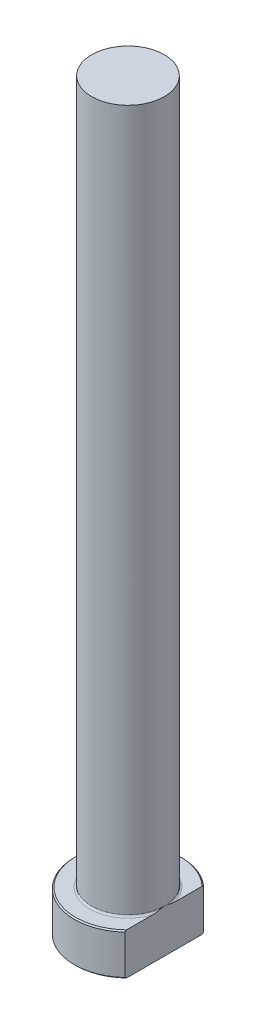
ISO-10303-21;
HEADER;
FILE_DESCRIPTION(('STEP AP214'),'2;1');
FILE_NAME('part.step','',(''),(''),'','','');
FILE_SCHEMA(('AUTOMOTIVE_DESIGN { 1 0 10303 214 1 1 1 1 }'));
ENDSEC;
DATA;
#1=APPLICATION_CONTEXT('core data for automotive mechanical design processes');
#2=APPLICATION_PROTOCOL_DEFINITION('international standard','automotive_design',2000,#1);
#3=PRODUCT_CONTEXT('',#1,'mechanical');
#4=PRODUCT('Part','Part','',(#3));
#5=PRODUCT_RELATED_PRODUCT_CATEGORY('part','',(#4));
#6=PRODUCT_DEFINITION_FORMATION('','',#4);
#7=PRODUCT_DEFINITION_CONTEXT('part definition',#1,'design');
#8=PRODUCT_DEFINITION('design','',#6,#7);
#9=PRODUCT_DEFINITION_SHAPE('','',#8);
#10=(LENGTH_UNIT() NAMED_UNIT(*) SI_UNIT(.MILLI.,.METRE.));
#11=(NAMED_UNIT(*) PLANE_ANGLE_UNIT() SI_UNIT($,.RADIAN.));
#12=(NAMED_UNIT(*) SI_UNIT($,.STERADIAN.) SOLID_ANGLE_UNIT());
#13=UNCERTAINTY_MEASURE_WITH_UNIT(LENGTH_MEASURE(1.E-05),#10,'distance_accuracy_value','');
#14=(GEOMETRIC_REPRESENTATION_CONTEXT(3) GLOBAL_UNCERTAINTY_ASSIGNED_CONTEXT((#13)) GLOBAL_UNIT_ASSIGNED_CONTEXT((#10,
#11,#12)) REPRESENTATION_CONTEXT('',''));
#15=CARTESIAN_POINT('',(0.,0.,0.));
#16=DIRECTION('',(0.,0.,1.));
#17=DIRECTION('',(1.,0.,0.));
#18=AXIS2_PLACEMENT_3D('',#15,#16,#17);
#19=CARTESIAN_POINT('',(0.,0.,0.));
#20=DIRECTION('',(0.,-1.,0.));
#21=DIRECTION('',(0.,0.,-1.));
#22=AXIS2_PLACEMENT_3D('',#19,#20,#21);
#23=PLANE('',#22);
#24=CARTESIAN_POINT('',(0.,0.,0.));
#25=DIRECTION('',(0.,-1.,0.));
#26=DIRECTION('',(0.,0.,-1.));
#27=AXIS2_PLACEMENT_3D('',#24,#25,#26);
#28=CIRCLE('',#27,8.79999999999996);
#29=CARTESIAN_POINT('',(6.09999999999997,0.,6.34271235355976));
#30=VERTEX_POINT('',#29);
#31=CARTESIAN_POINT('',(6.09999999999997,0.,-6.34271235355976));
#32=VERTEX_POINT('',#31);
#33=EDGE_CURVE('E98',#30,#32,#28,.T.);
#34=ORIENTED_EDGE('',*,*,#33,.T.);
#35=DIRECTION('',(0.,0.,1.));
#36=VECTOR('',#35,1.);
#37=CARTESIAN_POINT('',(6.09999999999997,0.,-6.61740130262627));
#38=LINE('',#37,#36);
#39=EDGE_CURVE('E83',#32,#30,#38,.T.);
#40=ORIENTED_EDGE('',*,*,#39,.T.);
#41=EDGE_LOOP('',(#34,#40));
#42=FACE_BOUND('',#41,.T.);
#43=ADVANCED_FACE('F32',(#42),#23,.T.);
#44=CARTESIAN_POINT('',(0.,259.958771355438,0.));
#45=DIRECTION('',(0.,1.,0.));
#46=DIRECTION('',(0.,0.,1.));
#47=AXIS2_PLACEMENT_3D('',#44,#45,#46);
#48=CYLINDRICAL_SURFACE('',#47,8.99999999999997);
#49=CARTESIAN_POINT('',(0.,6.79999999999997,0.));
#50=DIRECTION('',(0.,1.,0.));
#51=DIRECTION('',(0.,0.,1.));
#52=AXIS2_PLACEMENT_3D('',#49,#50,#51);
#53=CIRCLE('',#52,8.99999999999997);
#54=CARTESIAN_POINT('',(6.09999999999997,6.79999999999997,6.61740130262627));
#55=VERTEX_POINT('',#54);
#56=CARTESIAN_POINT('',(6.09999999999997,6.79999999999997,-6.61740130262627));
#57=VERTEX_POINT('',#56);
#58=EDGE_CURVE('E104',#55,#57,#53,.F.);
#59=ORIENTED_EDGE('',*,*,#58,.T.);
#60=DIRECTION('',(0.,-1.,0.));
#61=VECTOR('',#60,1.);
#62=CARTESIAN_POINT('',(6.09999999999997,125.,-6.61740130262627));
#63=LINE('',#62,#61);
#64=CARTESIAN_POINT('',(6.09999999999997,0.199999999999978,-6.61740130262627));
#65=VERTEX_POINT('',#64);
#66=EDGE_CURVE('E183',#57,#65,#63,.T.);
#67=ORIENTED_EDGE('',*,*,#66,.T.);
#68=CARTESIAN_POINT('',(0.,0.199999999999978,0.));
#69=DIRECTION('',(0.,-1.,0.));
#70=DIRECTION('',(0.,0.,-1.));
#71=AXIS2_PLACEMENT_3D('',#68,#69,#70);
#72=CIRCLE('',#71,8.99999999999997);
#73=CARTESIAN_POINT('',(6.09999999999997,0.199999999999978,6.61740130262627));
#74=VERTEX_POINT('',#73);
#75=EDGE_CURVE('E100',#65,#74,#72,.F.);
#76=ORIENTED_EDGE('',*,*,#75,.T.);
#77=DIRECTION('',(0.,-1.,0.));
#78=VECTOR('',#77,1.);
#79=CARTESIAN_POINT('',(6.09999999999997,125.,6.61740130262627));
#80=LINE('',#79,#78);
#81=EDGE_CURVE('E93',#55,#74,#80,.T.);
#82=ORIENTED_EDGE('',*,*,#81,.F.);
#83=EDGE_LOOP('',(#59,#67,#76,#82));
#84=FACE_BOUND('',#83,.T.);
#85=ADVANCED_FACE('F158',(#84),#48,.T.);
#86=CARTESIAN_POINT('',(-8.99999999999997,7.,0.));
#87=DIRECTION('',(0.,1.,0.));
#88=DIRECTION('',(0.,0.,1.));
#89=AXIS2_PLACEMENT_3D('',#86,#87,#88);
#90=PLANE('',#89);
#91=CARTESIAN_POINT('',(0.,7.,0.));
#92=DIRECTION('',(0.,1.,0.));
#93=DIRECTION('',(0.,0.,1.));
#94=AXIS2_PLACEMENT_3D('',#91,#92,#93);
#95=CIRCLE('',#94,8.79999999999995);
#96=CARTESIAN_POINT('',(6.09999999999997,7.,-6.34271235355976));
#97=VERTEX_POINT('',#96);
#98=CARTESIAN_POINT('',(6.09999999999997,7.,6.34271235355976));
#99=VERTEX_POINT('',#98);
#100=EDGE_CURVE('E178',#97,#99,#95,.T.);
#101=ORIENTED_EDGE('',*,*,#100,.T.);
#102=DIRECTION('',(0.,0.,-1.));
#103=VECTOR('',#102,1.);
#104=CARTESIAN_POINT('',(6.09999999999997,7.,0.));
#105=LINE('',#104,#103);
#106=CARTESIAN_POINT('',(6.09999999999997,6.99999999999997,1.9364916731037));
#107=VERTEX_POINT('',#106);
#108=EDGE_CURVE('E57',#99,#107,#105,.T.);
#109=ORIENTED_EDGE('',*,*,#108,.T.);
#110=CARTESIAN_POINT('',(0.,7.,0.));
#111=DIRECTION('',(0.,1.,0.));
#112=DIRECTION('',(0.,0.,1.));
#113=AXIS2_PLACEMENT_3D('',#110,#111,#112);
#114=CIRCLE('',#113,6.39999999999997);
#115=CARTESIAN_POINT('',(6.09999999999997,6.99999999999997,-1.9364916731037));
#116=VERTEX_POINT('',#115);
#117=EDGE_CURVE('E107',#107,#116,#114,.F.);
#118=ORIENTED_EDGE('',*,*,#117,.T.);
#119=EDGE_CURVE('E136',#116,#97,#105,.T.);
#120=ORIENTED_EDGE('',*,*,#119,.T.);
#121=EDGE_LOOP('',(#101,#109,#118,#120));
#122=FACE_BOUND('',#121,.T.);
#123=ADVANCED_FACE('F147',(#122),#90,.T.);
#124=CARTESIAN_POINT('',(0.,7.00000000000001,0.));
#125=DIRECTION('',(0.,-1.,0.));
#126=DIRECTION('',(0.,0.,-1.));
#127=AXIS2_PLACEMENT_3D('',#124,#125,#126);
#128=CONICAL_SURFACE('',#127,8.79999999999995,0.785398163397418);
#129=ORIENTED_EDGE('',*,*,#58,.F.);
#130=CARTESIAN_POINT('',(6.09999999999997,0.0143792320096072,14.5593895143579));
#131=CARTESIAN_POINT('',(6.09999999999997,0.214324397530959,14.3426005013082));
#132=CARTESIAN_POINT('',(6.09999999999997,0.413913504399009,14.1254831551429));
#133=CARTESIAN_POINT('',(6.09999999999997,0.812271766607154,13.6904946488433));
#134=CARTESIAN_POINT('',(6.09999999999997,1.0110409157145,13.472623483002));
#135=CARTESIAN_POINT('',(6.09999999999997,1.60603894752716,12.8176429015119));
#136=CARTESIAN_POINT('',(6.09999999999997,2.00087078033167,12.3792612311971));
#137=CARTESIAN_POINT('',(6.09999999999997,2.78792222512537,11.4954287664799));
#138=CARTESIAN_POINT('',(6.09999999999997,3.18011200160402,11.0499513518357));
#139=CARTESIAN_POINT('',(6.09999999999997,3.95753447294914,10.1530375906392));
#140=CARTESIAN_POINT('',(6.09999999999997,4.34276798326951,9.70160195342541));
#141=CARTESIAN_POINT('',(6.09999999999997,5.03085646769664,8.87725822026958));
#142=CARTESIAN_POINT('',(6.09999999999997,5.33541849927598,8.50578180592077));
#143=CARTESIAN_POINT('',(6.09999999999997,5.78551221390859,7.94308202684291));
#144=CARTESIAN_POINT('',(6.09999999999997,5.9344388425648,7.75457459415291));
#145=CARTESIAN_POINT('',(6.09999999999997,6.22957503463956,7.37544710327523));
#146=CARTESIAN_POINT('',(6.09999999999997,6.37578465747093,7.18482709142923));
#147=CARTESIAN_POINT('',(6.09999999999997,6.66478900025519,6.80131984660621));
#148=CARTESIAN_POINT('',(6.09999999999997,6.80758709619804,6.60843516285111));
#149=CARTESIAN_POINT('',(6.09999999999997,7.08920912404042,6.21979246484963));
#150=CARTESIAN_POINT('',(6.09999999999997,7.22803324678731,6.02403458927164));
#151=CARTESIAN_POINT('',(6.09999999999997,7.50074563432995,5.62920968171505));
#152=CARTESIAN_POINT('',(6.09999999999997,7.63463576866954,5.43014394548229));
#153=CARTESIAN_POINT('',(6.09999999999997,7.89632379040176,5.02806147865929));
#154=CARTESIAN_POINT('',(6.09999999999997,8.02412236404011,4.82504519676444));
#155=CARTESIAN_POINT('',(6.09999999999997,8.27075787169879,4.41652900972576));
#156=CARTESIAN_POINT('',(6.09999999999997,8.38967506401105,4.21107783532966));
#157=CARTESIAN_POINT('',(6.09999999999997,8.61801299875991,3.79489291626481));
#158=CARTESIAN_POINT('',(6.09999999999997,8.72743269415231,3.58415859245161));
#159=CARTESIAN_POINT('',(6.09999999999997,8.93404173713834,3.15694629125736));
#160=CARTESIAN_POINT('',(6.09999999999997,9.03124152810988,2.9404734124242));
#161=CARTESIAN_POINT('',(6.09999999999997,9.21017577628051,2.50119284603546));
#162=CARTESIAN_POINT('',(6.09999999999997,9.29191471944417,2.27838701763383));
#163=CARTESIAN_POINT('',(6.09999999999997,9.42038701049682,1.87551854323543));
#164=CARTESIAN_POINT('',(6.09999999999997,9.47086768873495,1.69665770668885));
#165=CARTESIAN_POINT('',(6.09999999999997,9.55795989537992,1.33556522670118));
#166=CARTESIAN_POINT('',(6.09999999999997,9.59457323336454,1.15333402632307));
#167=CARTESIAN_POINT('',(6.09999999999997,9.65210004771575,0.786944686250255));
#168=CARTESIAN_POINT('',(6.09999999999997,9.67306111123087,0.602794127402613));
#169=CARTESIAN_POINT('',(6.09999999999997,9.69831980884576,0.23334258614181));
#170=CARTESIAN_POINT('',(6.09999999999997,9.70261818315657,0.0480416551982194));
#171=CARTESIAN_POINT('',(6.09999999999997,9.69429534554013,-0.322485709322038));
#172=CARTESIAN_POINT('',(6.09999999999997,9.68164564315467,-0.507711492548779));
#173=CARTESIAN_POINT('',(6.09999999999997,9.64009976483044,-0.87631734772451));
#174=CARTESIAN_POINT('',(6.09999999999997,9.61120224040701,-1.05969726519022));
#175=CARTESIAN_POINT('',(6.09999999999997,9.53854055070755,-1.42403078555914));
#176=CARTESIAN_POINT('',(6.09999999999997,9.49473105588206,-1.60497522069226));
#177=CARTESIAN_POINT('',(6.09999999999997,9.39417906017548,-1.96319042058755));
#178=CARTESIAN_POINT('',(6.09999999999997,9.33743624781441,-2.14046109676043));
#179=CARTESIAN_POINT('',(6.09999999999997,9.20325707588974,-2.5185253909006));
#180=CARTESIAN_POINT('',(6.09999999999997,9.12397188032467,-2.71865799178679));
#181=CARTESIAN_POINT('',(6.09999999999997,8.95352574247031,-3.11384323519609));
#182=CARTESIAN_POINT('',(6.09999999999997,8.86235948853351,-3.30889355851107));
#183=CARTESIAN_POINT('',(6.09999999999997,8.67035859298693,-3.69456420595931));
#184=CARTESIAN_POINT('',(6.09999999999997,8.5695073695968,-3.88517621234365));
#185=CARTESIAN_POINT('',(6.09999999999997,8.36017703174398,-4.2621030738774));
#186=CARTESIAN_POINT('',(6.09999999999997,8.25169895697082,-4.44841851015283));
#187=CARTESIAN_POINT('',(6.09999999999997,8.02723055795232,-4.81954803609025));
#188=CARTESIAN_POINT('',(6.09999999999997,7.91116499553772,-5.00431640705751));
#189=CARTESIAN_POINT('',(6.09999999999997,7.67391977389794,-5.37053346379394));
#190=CARTESIAN_POINT('',(6.09999999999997,7.55273998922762,-5.55198206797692));
#191=CARTESIAN_POINT('',(6.09999999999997,7.30632827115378,-5.91182164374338));
#192=CARTESIAN_POINT('',(6.09999999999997,7.18110067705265,-6.09021559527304));
#193=CARTESIAN_POINT('',(6.09999999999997,6.9271902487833,-6.44453156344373));
#194=CARTESIAN_POINT('',(6.09999999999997,6.79850727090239,-6.62045347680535));
#195=CARTESIAN_POINT('',(6.09999999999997,6.40743139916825,-7.146010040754));
#196=CARTESIAN_POINT('',(6.09999999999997,6.14071269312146,-7.49242581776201));
#197=CARTESIAN_POINT('',(6.09999999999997,5.59909026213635,-8.17880344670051));
#198=CARTESIAN_POINT('',(6.09999999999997,5.32418574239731,-8.51876466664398));
#199=CARTESIAN_POINT('',(6.09999999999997,4.76812622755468,-9.19396082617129));
#200=CARTESIAN_POINT('',(6.09999999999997,4.48696661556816,-9.52919195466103));
#201=CARTESIAN_POINT('',(6.09999999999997,3.92006700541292,-10.1957589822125));
#202=CARTESIAN_POINT('',(6.09999999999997,3.63432692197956,-10.5270948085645));
#203=CARTESIAN_POINT('',(6.09999999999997,3.07379660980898,-11.1700382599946));
#204=CARTESIAN_POINT('',(6.09999999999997,2.79918078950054,-11.4817981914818));
#205=CARTESIAN_POINT('',(6.09999999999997,2.24738477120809,-12.1030461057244));
#206=CARTESIAN_POINT('',(6.09999999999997,1.9702045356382,-12.4125340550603));
#207=CARTESIAN_POINT('',(6.09999999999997,1.41421579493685,-13.029143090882));
#208=CARTESIAN_POINT('',(6.09999999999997,1.13541061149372,-13.3362671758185));
#209=CARTESIAN_POINT('',(6.09999999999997,0.576091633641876,-13.9489357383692));
#210=CARTESIAN_POINT('',(6.09999999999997,0.295577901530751,-14.2544802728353));
#211=CARTESIAN_POINT('',(6.09999999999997,0.014379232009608,-14.5593895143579));
#212=B_SPLINE_CURVE_WITH_KNOTS('',3,(#130,#131,#132,#133,#134,#135,#136,#137,#138,#139,#140,
#141,#142,#143,#144,#145,#146,#147,#148,#149,#150,#151,#152,#153,#154,#155,#156,#157,#158,#159,
#160,#161,#162,#163,#164,#165,#166,#167,#168,#169,#170,#171,#172,#173,#174,#175,#176,#177,#178,
#179,#180,#181,#182,#183,#184,#185,#186,#187,#188,#189,#190,#191,#192,#193,#194,#195,#196,#197,
#198,#199,#200,#201,#202,#203,#204,#205,#206,#207,#208,#209,#210,#211),.UNSPECIFIED.,.F.,.F.,(4,
2,2,2,2,2,2,2,2,2,2,2,2,2,2,2,2,2,2,2,2,2,2,2,2,2,2,2,2,2,2,2,2,2,2,2,2,2,2,2,4),(0.,
0.884747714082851,1.76950214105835,3.53939834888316,5.31990146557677,7.10019448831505,
8.54118050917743,9.26187437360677,9.98255246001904,10.7024850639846,11.4223830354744,
12.1420053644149,12.8615464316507,13.573503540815,14.285539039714,14.9969618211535,
15.7081778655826,16.2652530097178,16.8222554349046,17.3775574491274,17.9328347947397,
18.4890467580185,19.0453048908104,19.6032692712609,20.1612470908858,20.8065589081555,
21.4521602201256,22.0988872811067,22.7455263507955,23.4000191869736,24.0545280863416,
24.708357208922,25.3622135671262,26.6736120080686,27.9851381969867,29.2976668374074,
30.6102199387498,31.8565868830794,33.102972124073,34.3473597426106,35.5917022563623),.UNSPECIFIED.);
#213=EDGE_CURVE('E135',#55,#99,#212,.T.);
#214=ORIENTED_EDGE('',*,*,#213,.T.);
#215=ORIENTED_EDGE('',*,*,#100,.F.);
#216=EDGE_CURVE('E127',#97,#57,#212,.T.);
#217=ORIENTED_EDGE('',*,*,#216,.T.);
#218=EDGE_LOOP('',(#129,#214,#215,#217));
#219=FACE_BOUND('',#218,.T.);
#220=ADVANCED_FACE('F143',(#219),#128,.T.);
#221=CARTESIAN_POINT('',(0.,0.199999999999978,0.));
#222=DIRECTION('',(0.,1.,0.));
#223=DIRECTION('',(0.,0.,1.));
#224=AXIS2_PLACEMENT_3D('',#221,#222,#223);
#225=CONICAL_SURFACE('',#224,8.99999999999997,0.785398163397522);
#226=ORIENTED_EDGE('',*,*,#75,.F.);
#227=CARTESIAN_POINT('',(6.09999999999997,6.98562076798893,-14.5593895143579));
#228=CARTESIAN_POINT('',(6.09999999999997,6.78567560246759,-14.3426005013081));
#229=CARTESIAN_POINT('',(6.09999999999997,6.58608649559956,-14.1254831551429));
#230=CARTESIAN_POINT('',(6.09999999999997,6.18772823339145,-13.6904946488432));
#231=CARTESIAN_POINT('',(6.09999999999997,5.98895908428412,-13.4726234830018));
#232=CARTESIAN_POINT('',(6.09999999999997,5.39396105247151,-12.8176429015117));
#233=CARTESIAN_POINT('',(6.09999999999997,4.99912921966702,-12.3792612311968));
#234=CARTESIAN_POINT('',(6.09999999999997,4.21207777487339,-11.4954287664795));
#235=CARTESIAN_POINT('',(6.09999999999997,3.81988799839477,-11.0499513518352));
#236=CARTESIAN_POINT('',(6.09999999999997,3.04246552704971,-10.1530375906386));
#237=CARTESIAN_POINT('',(6.09999999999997,2.65723201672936,-9.70160195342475));
#238=CARTESIAN_POINT('',(6.09999999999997,1.96914353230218,-8.87725822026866));
#239=CARTESIAN_POINT('',(6.09999999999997,1.66458150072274,-8.50578180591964));
#240=CARTESIAN_POINT('',(6.09999999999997,1.21448778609,-7.94308202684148));
#241=CARTESIAN_POINT('',(6.09999999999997,1.06556115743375,-7.75457459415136));
#242=CARTESIAN_POINT('',(6.09999999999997,0.770424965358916,-7.37544710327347));
#243=CARTESIAN_POINT('',(6.09999999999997,0.624215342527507,-7.18482709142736));
#244=CARTESIAN_POINT('',(6.09999999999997,0.335210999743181,-6.80131984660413));
#245=CARTESIAN_POINT('',(6.09999999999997,0.192412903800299,-6.60843516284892));
#246=CARTESIAN_POINT('',(6.09999999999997,-0.0892091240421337,-6.21979246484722));
#247=CARTESIAN_POINT('',(6.09999999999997,-0.228033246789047,-6.02403458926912));
#248=CARTESIAN_POINT('',(6.09999999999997,-0.500745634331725,-5.6292096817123));
#249=CARTESIAN_POINT('',(6.09999999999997,-0.634635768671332,-5.43014394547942));
#250=CARTESIAN_POINT('',(6.09999999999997,-0.896323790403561,-5.02806147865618));
#251=CARTESIAN_POINT('',(6.09999999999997,-1.02412236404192,-4.8250451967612));
#252=CARTESIAN_POINT('',(6.09999999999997,-1.27075787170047,-4.41652900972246));
#253=CARTESIAN_POINT('',(6.09999999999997,-1.3896750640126,-4.21107783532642));
#254=CARTESIAN_POINT('',(6.09999999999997,-1.61801299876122,-3.79489291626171));
#255=CARTESIAN_POINT('',(6.09999999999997,-1.7274326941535,-3.58415859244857));
#256=CARTESIAN_POINT('',(6.09999999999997,-1.93404173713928,-3.15694629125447));
#257=CARTESIAN_POINT('',(6.09999999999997,-2.03124152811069,-2.94047341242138));
#258=CARTESIAN_POINT('',(6.09999999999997,-2.21017577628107,-2.50119284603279));
#259=CARTESIAN_POINT('',(6.09999999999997,-2.2919147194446,-2.27838701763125));
#260=CARTESIAN_POINT('',(6.09999999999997,-2.42038701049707,-1.87551854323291));
#261=CARTESIAN_POINT('',(6.09999999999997,-2.47086768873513,-1.69665770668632));
#262=CARTESIAN_POINT('',(6.09999999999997,-2.55795989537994,-1.33556522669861));
#263=CARTESIAN_POINT('',(6.09999999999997,-2.59457323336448,-1.15333402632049));
#264=CARTESIAN_POINT('',(6.09999999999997,-2.65210004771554,-0.786944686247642));
#265=CARTESIAN_POINT('',(6.09999999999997,-2.67306111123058,-0.60279412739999));
#266=CARTESIAN_POINT('',(6.09999999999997,-2.69831980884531,-0.233342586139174));
#267=CARTESIAN_POINT('',(6.09999999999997,-2.70261818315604,-0.0480416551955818));
#268=CARTESIAN_POINT('',(6.09999999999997,-2.69429534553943,0.322485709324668));
#269=CARTESIAN_POINT('',(6.09999999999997,-2.6816456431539,0.507711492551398));
#270=CARTESIAN_POINT('',(6.09999999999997,-2.64009976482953,0.876317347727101));
#271=CARTESIAN_POINT('',(6.09999999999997,-2.61120224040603,1.05969726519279));
#272=CARTESIAN_POINT('',(6.09999999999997,-2.53854055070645,1.42403078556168));
#273=CARTESIAN_POINT('',(6.09999999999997,-2.4947310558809,1.60497522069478));
#274=CARTESIAN_POINT('',(6.09999999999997,-2.39417906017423,1.96319042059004));
#275=CARTESIAN_POINT('',(6.09999999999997,-2.33743624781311,2.14046109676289));
#276=CARTESIAN_POINT('',(6.09999999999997,-2.20325707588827,2.51852539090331));
#277=CARTESIAN_POINT('',(6.09999999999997,-2.12397188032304,2.71865799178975));
#278=CARTESIAN_POINT('',(6.09999999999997,-1.95352574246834,3.11384323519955));
#279=CARTESIAN_POINT('',(6.09999999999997,-1.86235948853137,3.30889355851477));
#280=CARTESIAN_POINT('',(6.09999999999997,-1.67035859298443,3.69456420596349));
#281=CARTESIAN_POINT('',(6.09999999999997,-1.56950736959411,3.88517621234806));
#282=CARTESIAN_POINT('',(6.09999999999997,-1.36017703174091,4.26210307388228));
#283=CARTESIAN_POINT('',(6.09999999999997,-1.25169895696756,4.44841851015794));
#284=CARTESIAN_POINT('',(6.09999999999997,-1.02723055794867,4.81954803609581));
#285=CARTESIAN_POINT('',(6.09999999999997,-0.911164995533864,5.0043164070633));
#286=CARTESIAN_POINT('',(6.09999999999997,-0.673919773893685,5.37053346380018));
#287=CARTESIAN_POINT('',(6.09999999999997,-0.552739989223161,5.55198206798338));
#288=CARTESIAN_POINT('',(6.09999999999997,-0.306328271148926,5.91182164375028));
#289=CARTESIAN_POINT('',(6.09999999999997,-0.181100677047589,6.09021559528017));
#290=CARTESIAN_POINT('',(6.09999999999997,0.0728097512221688,6.44453156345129));
#291=CARTESIAN_POINT('',(6.09999999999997,0.201492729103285,6.62045347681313));
#292=CARTESIAN_POINT('',(6.09999999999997,0.592568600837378,7.14601004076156));
#293=CARTESIAN_POINT('',(6.09999999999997,0.859287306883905,7.49242581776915));
#294=CARTESIAN_POINT('',(6.09999999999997,1.40090973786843,8.17880344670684));
#295=CARTESIAN_POINT('',(6.09999999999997,1.67581425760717,8.51876466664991));
#296=CARTESIAN_POINT('',(6.09999999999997,2.23187377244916,9.19396082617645));
#297=CARTESIAN_POINT('',(6.09999999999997,2.51303338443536,9.52919195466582));
#298=CARTESIAN_POINT('',(6.09999999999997,3.07993299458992,10.1957589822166));
#299=CARTESIAN_POINT('',(6.09999999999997,3.36567307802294,10.5270948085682));
#300=CARTESIAN_POINT('',(6.09999999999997,3.92620339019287,11.1700382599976));
#301=CARTESIAN_POINT('',(6.09999999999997,4.20081921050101,11.4817981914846));
#302=CARTESIAN_POINT('',(6.09999999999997,4.75261522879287,12.1030461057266));
#303=CARTESIAN_POINT('',(6.09999999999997,5.02979546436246,12.4125340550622));
#304=CARTESIAN_POINT('',(6.09999999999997,5.58578420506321,13.0291430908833));
#305=CARTESIAN_POINT('',(6.09999999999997,5.86458938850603,13.3362671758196));
#306=CARTESIAN_POINT('',(6.09999999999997,6.42390836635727,13.9489357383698));
#307=CARTESIAN_POINT('',(6.09999999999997,6.70442209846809,14.2544802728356));
#308=CARTESIAN_POINT('',(6.09999999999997,6.98562076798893,14.5593895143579));
#309=B_SPLINE_CURVE_WITH_KNOTS('',3,(#227,#228,#229,#230,#231,#232,#233,#234,#235,#236,#237,
#238,#239,#240,#241,#242,#243,#244,#245,#246,#247,#248,#249,#250,#251,#252,#253,#254,#255,#256,
#257,#258,#259,#260,#261,#262,#263,#264,#265,#266,#267,#268,#269,#270,#271,#272,#273,#274,#275,
#276,#277,#278,#279,#280,#281,#282,#283,#284,#285,#286,#287,#288,#289,#290,#291,#292,#293,#294,
#295,#296,#297,#298,#299,#300,#301,#302,#303,#304,#305,#306,#307,#308),.UNSPECIFIED.,.F.,.F.,(4,
2,2,2,2,2,2,2,2,2,2,2,2,2,2,2,2,2,2,2,2,2,2,2,2,2,2,2,2,2,2,2,2,2,2,2,2,2,2,2,4),(0.,
0.884747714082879,1.76950214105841,3.53939834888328,5.31990146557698,7.10019448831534,
8.54118050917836,9.26187437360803,9.98255246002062,10.7024850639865,11.4223830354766,
12.1420053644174,12.8615464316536,13.5735035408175,14.2855390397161,14.9969618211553,
15.7081778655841,16.2652530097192,16.822255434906,17.3775574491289,17.9328347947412,
18.4890467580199,19.0453048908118,19.6032692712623,20.1612470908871,20.8065589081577,
21.4521602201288,22.0988872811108,22.7455263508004,23.4000191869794,24.0545280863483,
24.7083572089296,25.3622135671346,26.6736120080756,27.9851381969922,29.2976668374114,
30.6102199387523,31.8565868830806,33.102972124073,34.3473597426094,35.5917022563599),.UNSPECIFIED.);
#310=EDGE_CURVE('E86',#65,#32,#309,.T.);
#311=ORIENTED_EDGE('',*,*,#310,.T.);
#312=ORIENTED_EDGE('',*,*,#33,.F.);
#313=EDGE_CURVE('E89',#30,#74,#309,.T.);
#314=ORIENTED_EDGE('',*,*,#313,.T.);
#315=EDGE_LOOP('',(#226,#311,#312,#314));
#316=FACE_BOUND('',#315,.T.);
#317=ADVANCED_FACE('F97',(#316),#225,.T.);
#318=CARTESIAN_POINT('',(0.,7.29999999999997,0.));
#319=DIRECTION('',(0.,1.,0.));
#320=DIRECTION('',(0.,0.,1.));
#321=AXIS2_PLACEMENT_3D('',#318,#319,#320);
#322=TOROIDAL_SURFACE('',#321,6.39999999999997,0.3);
#323=CARTESIAN_POINT('',(6.09999999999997,7.29999999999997,0.));
#324=CARTESIAN_POINT('',(6.09999999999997,7.30000062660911,-8.49340882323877E-11));
#325=CARTESIAN_POINT('',(6.09999999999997,7.30000125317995,-2.89750604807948E-07));
#326=CARTESIAN_POINT('',(6.09999999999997,7.30000241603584,-1.06233729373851E-06));
#327=CARTESIAN_POINT('',(6.09999999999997,7.30000292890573,-1.56598288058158E-06));
#328=CARTESIAN_POINT('',(6.09999999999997,7.30000401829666,-2.78036834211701E-06));
#329=CARTESIAN_POINT('',(6.09999999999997,7.30000457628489,-3.51079357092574E-06));
#330=CARTESIAN_POINT('',(6.09999999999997,7.30000555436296,-5.00545869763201E-06));
#331=CARTESIAN_POINT('',(6.09999999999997,7.30000597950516,-5.76672403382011E-06));
#332=CARTESIAN_POINT('',(6.09999999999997,7.30000761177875,-8.78783125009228E-06));
#333=CARTESIAN_POINT('',(6.09999999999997,7.30000873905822,-1.10951031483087E-05));
#334=CARTESIAN_POINT('',(6.09999999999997,7.30001054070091,-1.56065756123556E-05));
#335=CARTESIAN_POINT('',(6.09999999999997,7.30001124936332,-1.77975625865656E-05));
#336=CARTESIAN_POINT('',(6.09999999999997,7.3000143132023,-2.72682416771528E-05));
#337=CARTESIAN_POINT('',(6.09999999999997,7.30001667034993,-3.45497120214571E-05));
#338=CARTESIAN_POINT('',(6.09999999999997,7.30002005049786,-4.8163199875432E-05));
#339=CARTESIAN_POINT('',(6.09999999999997,7.30002122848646,-5.44561398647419E-05));
#340=CARTESIAN_POINT('',(6.09999999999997,7.30002994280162,-0.000101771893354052));
#341=CARTESIAN_POINT('',(6.09999999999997,7.30003670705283,-0.000142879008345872));
#342=CARTESIAN_POINT('',(6.09999999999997,7.30006629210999,-0.000306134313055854));
#343=CARTESIAN_POINT('',(6.09999999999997,7.30009435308,-0.000427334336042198));
#344=CARTESIAN_POINT('',(6.09999999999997,7.30020422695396,-0.000909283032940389));
#345=CARTESIAN_POINT('',(6.09999999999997,7.30028277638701,-0.00127051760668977));
#346=CARTESIAN_POINT('',(6.09999999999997,7.30059854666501,-0.00271271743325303));
#347=CARTESIAN_POINT('',(6.09999999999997,7.30083994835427,-0.00379303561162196));
#348=CARTESIAN_POINT('',(6.09999999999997,7.30185162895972,-0.00833170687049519));
#349=CARTESIAN_POINT('',(6.09999999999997,7.30261657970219,-0.0117908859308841));
#350=CARTESIAN_POINT('',(6.09999999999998,7.30941584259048,-0.0425231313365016));
#351=CARTESIAN_POINT('',(6.09999999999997,7.31547175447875,-0.0697929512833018));
#352=CARTESIAN_POINT('',(6.09999999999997,7.32730575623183,-0.123231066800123));
#353=CARTESIAN_POINT('',(6.09999999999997,7.33308513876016,-0.149399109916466));
#354=CARTESIAN_POINT('',(6.09999999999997,7.34535810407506,-0.205120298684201));
#355=CARTESIAN_POINT('',(6.09999999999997,7.35184757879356,-0.234674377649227));
#356=CARTESIAN_POINT('',(6.09999999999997,7.36483397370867,-0.294125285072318));
#357=CARTESIAN_POINT('',(6.09999999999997,7.37133017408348,-0.324022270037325));
#358=CARTESIAN_POINT('',(6.09999999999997,7.3868079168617,-0.39575720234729));
#359=CARTESIAN_POINT('',(6.09999999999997,7.39574786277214,-0.437604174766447));
#360=CARTESIAN_POINT('',(6.09999999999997,7.41315372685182,-0.520210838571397));
#361=CARTESIAN_POINT('',(6.09999999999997,7.42162592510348,-0.560969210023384));
#362=CARTESIAN_POINT('',(6.09999999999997,7.44897438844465,-0.694856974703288));
#363=CARTESIAN_POINT('',(6.09999999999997,7.46725806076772,-0.788109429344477));
#364=CARTESIAN_POINT('',(6.09999999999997,7.50173201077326,-0.975940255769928));
#365=CARTESIAN_POINT('',(6.09999999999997,7.51790033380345,-1.07052272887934));
#366=CARTESIAN_POINT('',(6.09999999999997,7.5483609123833,-1.26941791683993));
#367=CARTESIAN_POINT('',(6.09999999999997,7.56231819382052,-1.37378304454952));
#368=CARTESIAN_POINT('',(6.09999999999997,7.58455179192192,-1.58284720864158));
#369=CARTESIAN_POINT('',(6.09999999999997,7.59284552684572,-1.68754421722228));
#370=CARTESIAN_POINT('',(6.09999999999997,7.59905685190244,-1.84322200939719));
#371=CARTESIAN_POINT('',(6.09999999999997,7.60011923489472,-1.89407517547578));
#372=CARTESIAN_POINT('',(6.09999999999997,7.59985882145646,-1.99583446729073));
#373=CARTESIAN_POINT('',(6.09999999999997,7.59853367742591,-2.04674059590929));
#374=CARTESIAN_POINT('',(6.09999999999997,7.59293461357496,-2.14745109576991));
#375=CARTESIAN_POINT('',(6.09999999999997,7.58871621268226,-2.19725829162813));
#376=CARTESIAN_POINT('',(6.09999999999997,7.57652343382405,-2.29636696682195));
#377=CARTESIAN_POINT('',(6.09999999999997,7.56855424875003,-2.34566904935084));
#378=CARTESIAN_POINT('',(6.09999999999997,7.54906685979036,-2.43557410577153));
#379=CARTESIAN_POINT('',(6.09999999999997,7.53830158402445,-2.47632837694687));
#380=CARTESIAN_POINT('',(6.09999999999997,7.51813116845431,-2.53619759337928));
#381=CARTESIAN_POINT('',(6.09999999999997,7.51071988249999,-2.55597892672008));
#382=CARTESIAN_POINT('',(6.09999999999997,7.49420581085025,-2.59481280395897));
#383=CARTESIAN_POINT('',(6.09999999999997,7.48510530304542,-2.61386628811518));
#384=CARTESIAN_POINT('',(6.09999999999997,7.46462437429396,-2.65097502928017));
#385=CARTESIAN_POINT('',(6.09999999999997,7.4532219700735,-2.66901833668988));
#386=CARTESIAN_POINT('',(6.09999999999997,7.42747894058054,-2.70281743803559));
#387=CARTESIAN_POINT('',(6.09999999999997,7.41316603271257,-2.71859257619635));
#388=CARTESIAN_POINT('',(6.09999999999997,7.39059237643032,-2.73744251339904));
#389=CARTESIAN_POINT('',(6.09999999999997,7.38392912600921,-2.74241546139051));
#390=CARTESIAN_POINT('',(6.09999999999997,7.36998483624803,-2.75142973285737));
#391=CARTESIAN_POINT('',(6.09999999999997,7.36270362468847,-2.75547079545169));
#392=CARTESIAN_POINT('',(6.09999999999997,7.34749053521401,-2.76237207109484));
#393=CARTESIAN_POINT('',(6.09999999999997,7.33955232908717,-2.76521867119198));
#394=CARTESIAN_POINT('',(6.09999999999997,7.3232826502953,-2.76936266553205));
#395=CARTESIAN_POINT('',(6.09999999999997,7.3149518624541,-2.7706626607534));
#396=CARTESIAN_POINT('',(6.09999999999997,7.29896440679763,-2.77151083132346));
#397=CARTESIAN_POINT('',(6.09999999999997,7.29131555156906,-2.77120796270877));
#398=CARTESIAN_POINT('',(6.09999999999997,7.27619804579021,-2.76922646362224));
#399=CARTESIAN_POINT('',(6.09999999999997,7.26872952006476,-2.76754690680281));
#400=CARTESIAN_POINT('',(6.09999999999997,7.25296547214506,-2.76260061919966));
#401=CARTESIAN_POINT('',(6.09999999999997,7.24473928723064,-2.75911619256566));
#402=CARTESIAN_POINT('',(6.09999999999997,7.22896148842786,-2.75086515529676));
#403=CARTESIAN_POINT('',(6.09999999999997,7.22141106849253,-2.74609633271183));
#404=CARTESIAN_POINT('',(6.09999999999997,7.20301227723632,-2.73270182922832));
#405=CARTESIAN_POINT('',(6.09999999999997,7.1926580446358,-2.72340416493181));
#406=CARTESIAN_POINT('',(6.09999999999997,7.1734395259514,-2.70338710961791));
#407=CARTESIAN_POINT('',(6.09999999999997,7.1645795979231,-2.69266371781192));
#408=CARTESIAN_POINT('',(6.09999999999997,7.14025540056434,-2.65971164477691));
#409=CARTESIAN_POINT('',(6.09999999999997,7.12651072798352,-2.63622875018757));
#410=CARTESIAN_POINT('',(6.09999999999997,7.10227969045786,-2.58772082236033));
#411=CARTESIAN_POINT('',(6.09999999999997,7.09179747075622,-2.56269387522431));
#412=CARTESIAN_POINT('',(6.09999999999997,7.0688846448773,-2.49991766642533));
#413=CARTESIAN_POINT('',(6.09999999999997,7.05782215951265,-2.46167427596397));
#414=CARTESIAN_POINT('',(6.09999999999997,7.03925041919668,-2.38430824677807));
#415=CARTESIAN_POINT('',(6.09999999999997,7.03174899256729,-2.34518386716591));
#416=CARTESIAN_POINT('',(6.09999999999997,7.01934937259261,-2.26583226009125));
#417=CARTESIAN_POINT('',(6.09999999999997,7.01449904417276,-2.22559771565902));
#418=CARTESIAN_POINT('',(6.09999999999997,7.00701943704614,-2.14499086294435));
#419=CARTESIAN_POINT('',(6.09999999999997,7.00438710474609,-2.10461882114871));
#420=CARTESIAN_POINT('',(6.09999999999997,6.99952969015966,-1.99154987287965));
#421=CARTESIAN_POINT('',(6.09999999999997,6.99930606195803,-1.91876811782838));
#422=CARTESIAN_POINT('',(6.09999999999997,7.00309053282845,-1.77330138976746));
#423=CARTESIAN_POINT('',(6.09999999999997,7.00710151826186,-1.70061651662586));
#424=CARTESIAN_POINT('',(6.09999999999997,7.01839350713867,-1.55515240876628));
#425=CARTESIAN_POINT('',(6.09999999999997,7.02569039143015,-1.4823744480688));
#426=CARTESIAN_POINT('',(6.09999999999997,7.0428282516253,-1.33711517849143));
#427=CARTESIAN_POINT('',(6.09999999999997,7.05266964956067,-1.2646339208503));
#428=CARTESIAN_POINT('',(6.09999999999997,7.08305970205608,-1.06158751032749));
#429=CARTESIAN_POINT('',(6.09999999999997,7.1058392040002,-0.931360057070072));
#430=CARTESIAN_POINT('',(6.09999999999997,7.15498382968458,-0.6732160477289));
#431=CARTESIAN_POINT('',(6.09999999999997,7.18130321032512,-0.545290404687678));
#432=CARTESIAN_POINT('',(6.09999999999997,7.2144838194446,-0.38980494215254));
#433=CARTESIAN_POINT('',(6.09999999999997,7.22045276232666,-0.362051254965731));
#434=CARTESIAN_POINT('',(6.09999999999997,7.23263801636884,-0.305748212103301));
#435=CARTESIAN_POINT('',(6.09999999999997,7.2388564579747,-0.277199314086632));
#436=CARTESIAN_POINT('',(6.09999999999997,7.25406223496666,-0.207696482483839));
#437=CARTESIAN_POINT('',(6.09999999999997,7.26307730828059,-0.166748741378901));
#438=CARTESIAN_POINT('',(6.09999999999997,7.28028241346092,-0.0889531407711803));
#439=CARTESIAN_POINT('',(6.09999999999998,7.28846503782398,-0.052103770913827));
#440=CARTESIAN_POINT('',(6.09999999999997,7.29738224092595,-0.0117959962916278));
#441=CARTESIAN_POINT('',(6.09999999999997,7.2981461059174,-0.00834194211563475));
#442=CARTESIAN_POINT('',(6.09999999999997,7.29915753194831,-0.0038044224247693));
#443=CARTESIAN_POINT('',(6.09999999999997,7.29939981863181,-0.00272013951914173));
#444=CARTESIAN_POINT('',(6.09999999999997,7.29971666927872,-0.00127300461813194));
#445=CARTESIAN_POINT('',(6.09999999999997,7.29979542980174,-0.000910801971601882));
#446=CARTESIAN_POINT('',(6.09999999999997,7.29990555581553,-0.000427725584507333));
#447=CARTESIAN_POINT('',(6.09999999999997,7.29993365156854,-0.000306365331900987));
#448=CARTESIAN_POINT('',(6.09999999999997,7.29996326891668,-0.000142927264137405));
#449=CARTESIAN_POINT('',(6.09999999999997,7.29997003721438,-0.000101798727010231));
#450=CARTESIAN_POINT('',(6.09999999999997,7.29997875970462,-5.44609821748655E-05));
#451=CARTESIAN_POINT('',(6.09999999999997,7.29997993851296,-4.81669455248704E-05));
#452=CARTESIAN_POINT('',(6.09999999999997,7.29998332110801,-3.45511307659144E-05));
#453=CARTESIAN_POINT('',(6.09999999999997,7.29998568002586,-2.726848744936E-05));
#454=CARTESIAN_POINT('',(6.09999999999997,7.2999887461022,-1.77965710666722E-05));
#455=CARTESIAN_POINT('',(6.09999999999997,7.29998945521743,-1.5605504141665E-05));
#456=CARTESIAN_POINT('',(6.09999999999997,7.29999125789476,-1.10939383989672E-05));
#457=CARTESIAN_POINT('',(6.09999999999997,7.29999238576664,-8.78666464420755E-06));
#458=CARTESIAN_POINT('',(6.09999999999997,7.29999401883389,-5.76563104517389E-06));
#459=CARTESIAN_POINT('',(6.09999999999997,7.2999944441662,-5.00441018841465E-06));
#460=CARTESIAN_POINT('',(6.09999999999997,7.29999542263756,-3.50986831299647E-06));
#461=CARTESIAN_POINT('',(6.09999999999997,7.29999598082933,-2.77952359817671E-06));
#462=CARTESIAN_POINT('',(6.09999999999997,7.29999707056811,-1.56532290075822E-06));
#463=CARTESIAN_POINT('',(6.09999999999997,7.29999758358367,-1.06177376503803E-06));
#464=CARTESIAN_POINT('',(6.09999999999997,7.29999874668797,-2.89436475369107E-07));
#465=CARTESIAN_POINT('',(6.09999999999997,7.29999937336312,8.49378445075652E-11));
#466=CARTESIAN_POINT('',(6.09999999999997,7.29999999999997,0.));
#467=B_SPLINE_CURVE_WITH_KNOTS('',3,(#323,#324,#325,#326,#327,#328,#329,#330,#331,#332,#333,
#334,#335,#336,#337,#338,#339,#340,#341,#342,#343,#344,#345,#346,#347,#348,#349,#350,#351,#352,
#353,#354,#355,#356,#357,#358,#359,#360,#361,#362,#363,#364,#365,#366,#367,#368,#369,#370,#371,
#372,#373,#374,#375,#376,#377,#378,#379,#380,#381,#382,#383,#384,#385,#386,#387,#388,#389,#390,
#391,#392,#393,#394,#395,#396,#397,#398,#399,#400,#401,#402,#403,#404,#405,#406,#407,#408,#409,
#410,#411,#412,#413,#414,#415,#416,#417,#418,#419,#420,#421,#422,#423,#424,#425,#426,#427,#428,
#429,#430,#431,#432,#433,#434,#435,#436,#437,#438,#439,#440,#441,#442,#443,#444,#445,#446,#447,
#448,#449,#450,#451,#452,#453,#454,#455,#456,#457,#458,#459,#460,#461,#462,#463,#464,#465,#466),
.UNSPECIFIED.,.T.,.F.,(4,2,2,2,2,2,2,2,2,2,2,2,2,2,2,2,2,2,2,2,2,2,2,2,2,2,2,2,2,2,2,2,2,2,2,2,
2,2,2,2,2,2,2,2,2,2,2,2,2,2,2,2,2,2,2,2,2,2,2,2,2,2,2,2,2,2,2,2,2,2,2,4),(0.,
1.91250960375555E-06,4.08178522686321E-06,6.8194531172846E-06,9.4346481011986E-06,
1.71137963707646E-05,2.40155063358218E-05,4.6944459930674E-05,6.61299340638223E-05,
0.000191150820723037,0.00056409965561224,0.00167341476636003,0.00499394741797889,
0.015622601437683,0.0994231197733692,0.179819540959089,0.270593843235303,0.362377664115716,
0.49075076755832,0.6156392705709,0.900704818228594,1.18852716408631,1.50431807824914,
1.81913334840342,1.97168386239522,2.12438445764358,2.27423396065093,2.4238766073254,
2.55004267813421,2.61335958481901,2.67659172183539,2.74045901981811,2.80374440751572,
2.82862908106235,2.85352071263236,2.87868879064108,2.90381448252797,2.92664866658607,
2.94949822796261,2.97615207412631,3.00285211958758,3.04436429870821,3.0859955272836,
3.16716680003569,3.24844079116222,3.36758630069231,3.48699253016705,3.60848882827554,
3.72981758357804,3.94797165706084,4.16627452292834,4.38564396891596,4.60504982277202,
5.00154620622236,5.3933388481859,5.47850384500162,5.56615847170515,5.69194439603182,
5.80518254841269,5.81579547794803,5.81912819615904,5.82024048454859,5.82061392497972,
5.82073901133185,5.82075820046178,5.82078113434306,5.82078803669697,5.82079571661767,
5.82079833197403,5.820801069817,5.82080323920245,5.82080515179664),.UNSPECIFIED.);
#468=CARTESIAN_POINT('',(6.09999999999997,7.29999999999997,0.));
#469=VERTEX_POINT('',#468);
#470=EDGE_CURVE('E11',#116,#469,#467,.T.);
#471=ORIENTED_EDGE('',*,*,#470,.F.);
#472=ORIENTED_EDGE('',*,*,#117,.F.);
#473=CARTESIAN_POINT('',(6.09999999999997,7.29999999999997,0.));
#474=CARTESIAN_POINT('',(6.09999999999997,7.29999937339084,8.49339302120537E-11));
#475=CARTESIAN_POINT('',(6.09999999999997,7.29999874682,2.89750604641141E-07));
#476=CARTESIAN_POINT('',(6.09999999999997,7.29999758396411,1.06233729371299E-06));
#477=CARTESIAN_POINT('',(6.09999999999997,7.29999707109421,1.56598288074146E-06));
#478=CARTESIAN_POINT('',(6.09999999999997,7.29999598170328,2.78036834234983E-06));
#479=CARTESIAN_POINT('',(6.09999999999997,7.29999542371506,3.51079357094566E-06));
#480=CARTESIAN_POINT('',(6.09999999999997,7.29999444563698,5.00545869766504E-06));
#481=CARTESIAN_POINT('',(6.09999999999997,7.29999402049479,5.76672403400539E-06));
#482=CARTESIAN_POINT('',(6.09999999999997,7.2999923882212,8.78783125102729E-06));
#483=CARTESIAN_POINT('',(6.09999999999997,7.29999126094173,1.10951031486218E-05));
#484=CARTESIAN_POINT('',(6.09999999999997,7.29998945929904,1.56065756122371E-05));
#485=CARTESIAN_POINT('',(6.09999999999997,7.29998875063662,1.77975625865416E-05));
#486=CARTESIAN_POINT('',(6.09999999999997,7.29998568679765,2.72682416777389E-05));
#487=CARTESIAN_POINT('',(6.09999999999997,7.29998332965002,3.45497120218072E-05));
#488=CARTESIAN_POINT('',(6.09999999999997,7.29997994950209,4.81631998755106E-05));
#489=CARTESIAN_POINT('',(6.09999999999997,7.29997877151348,5.44561398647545E-05));
#490=CARTESIAN_POINT('',(6.09999999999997,7.29997005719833,0.000101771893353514));
#491=CARTESIAN_POINT('',(6.09999999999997,7.29996329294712,0.000142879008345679));
#492=CARTESIAN_POINT('',(6.09999999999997,7.29993370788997,0.000306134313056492));
#493=CARTESIAN_POINT('',(6.09999999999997,7.29990564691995,0.000427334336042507));
#494=CARTESIAN_POINT('',(6.09999999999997,7.29979577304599,0.000909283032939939));
#495=CARTESIAN_POINT('',(6.09999999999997,7.29971722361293,0.00127051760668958));
#496=CARTESIAN_POINT('',(6.09999999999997,7.29940145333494,0.00271271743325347));
#497=CARTESIAN_POINT('',(6.09999999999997,7.29916005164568,0.00379303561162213));
#498=CARTESIAN_POINT('',(6.09999999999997,7.29814837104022,0.00833170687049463));
#499=CARTESIAN_POINT('',(6.09999999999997,7.29738342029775,0.0117908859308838));
#500=CARTESIAN_POINT('',(6.09999999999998,7.29058415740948,0.0425231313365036));
#501=CARTESIAN_POINT('',(6.09999999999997,7.2845282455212,0.0697929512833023));
#502=CARTESIAN_POINT('',(6.09999999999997,7.27269424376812,0.123231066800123));
#503=CARTESIAN_POINT('',(6.09999999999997,7.26691486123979,0.149399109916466));
#504=CARTESIAN_POINT('',(6.09999999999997,7.25464189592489,0.205120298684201));
#505=CARTESIAN_POINT('',(6.09999999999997,7.24815242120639,0.234674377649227));
#506=CARTESIAN_POINT('',(6.09999999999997,7.23516602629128,0.294125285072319));
#507=CARTESIAN_POINT('',(6.09999999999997,7.22866982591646,0.324022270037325));
#508=CARTESIAN_POINT('',(6.09999999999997,7.21319208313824,0.39575720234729));
#509=CARTESIAN_POINT('',(6.09999999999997,7.2042521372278,0.437604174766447));
#510=CARTESIAN_POINT('',(6.09999999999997,7.18684627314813,0.520210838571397));
#511=CARTESIAN_POINT('',(6.09999999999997,7.17837407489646,0.560969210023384));
#512=CARTESIAN_POINT('',(6.09999999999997,7.1510256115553,0.694856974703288));
#513=CARTESIAN_POINT('',(6.09999999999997,7.13274193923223,0.788109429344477));
#514=CARTESIAN_POINT('',(6.09999999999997,7.09826798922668,0.975940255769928));
#515=CARTESIAN_POINT('',(6.09999999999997,7.0820996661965,1.07052272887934));
#516=CARTESIAN_POINT('',(6.09999999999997,7.05163908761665,1.26941791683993));
#517=CARTESIAN_POINT('',(6.09999999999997,7.03768180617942,1.37378304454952));
#518=CARTESIAN_POINT('',(6.09999999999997,7.01544820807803,1.58284720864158));
#519=CARTESIAN_POINT('',(6.09999999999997,7.00715447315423,1.68754421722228));
#520=CARTESIAN_POINT('',(6.09999999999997,7.0009431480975,1.84322200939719));
#521=CARTESIAN_POINT('',(6.09999999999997,6.99988076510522,1.89407517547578));
#522=CARTESIAN_POINT('',(6.09999999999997,7.00014117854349,1.99583446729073));
#523=CARTESIAN_POINT('',(6.09999999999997,7.00146632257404,2.04674059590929));
#524=CARTESIAN_POINT('',(6.09999999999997,7.00706538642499,2.14745109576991));
#525=CARTESIAN_POINT('',(6.09999999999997,7.01128378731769,2.19725829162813));
#526=CARTESIAN_POINT('',(6.09999999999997,7.0234765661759,2.29636696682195));
#527=CARTESIAN_POINT('',(6.09999999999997,7.03144575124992,2.34566904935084));
#528=CARTESIAN_POINT('',(6.09999999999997,7.05093314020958,2.43557410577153));
#529=CARTESIAN_POINT('',(6.09999999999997,7.06169841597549,2.47632837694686));
#530=CARTESIAN_POINT('',(6.09999999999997,7.08186883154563,2.53619759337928));
#531=CARTESIAN_POINT('',(6.09999999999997,7.08928011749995,2.55597892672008));
#532=CARTESIAN_POINT('',(6.09999999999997,7.1057941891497,2.59481280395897));
#533=CARTESIAN_POINT('',(6.09999999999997,7.11489469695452,2.61386628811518));
#534=CARTESIAN_POINT('',(6.09999999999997,7.13537562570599,2.65097502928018));
#535=CARTESIAN_POINT('',(6.09999999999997,7.14677802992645,2.66901833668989));
#536=CARTESIAN_POINT('',(6.09999999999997,7.17252105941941,2.70281743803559));
#537=CARTESIAN_POINT('',(6.09999999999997,7.18683396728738,2.71859257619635));
#538=CARTESIAN_POINT('',(6.09999999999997,7.20940762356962,2.73744251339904));
#539=CARTESIAN_POINT('',(6.09999999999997,7.21607087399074,2.74241546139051));
#540=CARTESIAN_POINT('',(6.09999999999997,7.23001516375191,2.75142973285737));
#541=CARTESIAN_POINT('',(6.09999999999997,7.23729637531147,2.75547079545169));
#542=CARTESIAN_POINT('',(6.09999999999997,7.25250946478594,2.76237207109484));
#543=CARTESIAN_POINT('',(6.09999999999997,7.26044767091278,2.76521867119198));
#544=CARTESIAN_POINT('',(6.09999999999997,7.27671734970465,2.76936266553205));
#545=CARTESIAN_POINT('',(6.09999999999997,7.28504813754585,2.7706626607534));
#546=CARTESIAN_POINT('',(6.09999999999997,7.30103559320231,2.77151083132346));
#547=CARTESIAN_POINT('',(6.09999999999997,7.30868444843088,2.77120796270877));
#548=CARTESIAN_POINT('',(6.09999999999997,7.32380195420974,2.76922646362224));
#549=CARTESIAN_POINT('',(6.09999999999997,7.33127047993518,2.76754690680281));
#550=CARTESIAN_POINT('',(6.09999999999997,7.34703452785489,2.76260061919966));
#551=CARTESIAN_POINT('',(6.09999999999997,7.35526071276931,2.75911619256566));
#552=CARTESIAN_POINT('',(6.09999999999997,7.37103851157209,2.75086515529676));
#553=CARTESIAN_POINT('',(6.09999999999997,7.37858893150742,2.74609633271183));
#554=CARTESIAN_POINT('',(6.09999999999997,7.39698772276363,2.73270182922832));
#555=CARTESIAN_POINT('',(6.09999999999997,7.40734195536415,2.72340416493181));
#556=CARTESIAN_POINT('',(6.09999999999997,7.42656047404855,2.70338710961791));
#557=CARTESIAN_POINT('',(6.09999999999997,7.43542040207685,2.69266371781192));
#558=CARTESIAN_POINT('',(6.09999999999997,7.45974459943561,2.65971164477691));
#559=CARTESIAN_POINT('',(6.09999999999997,7.47348927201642,2.63622875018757));
#560=CARTESIAN_POINT('',(6.09999999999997,7.49772030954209,2.58772082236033));
#561=CARTESIAN_POINT('',(6.09999999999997,7.50820252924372,2.56269387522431));
#562=CARTESIAN_POINT('',(6.09999999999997,7.53111535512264,2.49991766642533));
#563=CARTESIAN_POINT('',(6.09999999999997,7.54217784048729,2.46167427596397));
#564=CARTESIAN_POINT('',(6.09999999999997,7.56074958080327,2.38430824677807));
#565=CARTESIAN_POINT('',(6.09999999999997,7.56825100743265,2.34518386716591));
#566=CARTESIAN_POINT('',(6.09999999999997,7.58065062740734,2.26583226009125));
#567=CARTESIAN_POINT('',(6.09999999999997,7.58550095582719,2.22559771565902));
#568=CARTESIAN_POINT('',(6.09999999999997,7.59298056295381,2.14499086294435));
#569=CARTESIAN_POINT('',(6.09999999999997,7.59561289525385,2.10461882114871));
#570=CARTESIAN_POINT('',(6.09999999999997,7.60047030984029,1.99154987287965));
#571=CARTESIAN_POINT('',(6.09999999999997,7.60069393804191,1.91876811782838));
#572=CARTESIAN_POINT('',(6.09999999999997,7.59690946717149,1.77330138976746));
#573=CARTESIAN_POINT('',(6.09999999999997,7.59289848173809,1.70061651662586));
#574=CARTESIAN_POINT('',(6.09999999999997,7.58160649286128,1.55515240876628));
#575=CARTESIAN_POINT('',(6.09999999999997,7.5743096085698,1.4823744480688));
#576=CARTESIAN_POINT('',(6.09999999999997,7.55717174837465,1.33711517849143));
#577=CARTESIAN_POINT('',(6.09999999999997,7.54733035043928,1.2646339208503));
#578=CARTESIAN_POINT('',(6.09999999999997,7.51694029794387,1.06158751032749));
#579=CARTESIAN_POINT('',(6.09999999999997,7.49416079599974,0.931360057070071));
#580=CARTESIAN_POINT('',(6.09999999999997,7.44501617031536,0.673216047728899));
#581=CARTESIAN_POINT('',(6.09999999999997,7.41869678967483,0.545290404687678));
#582=CARTESIAN_POINT('',(6.09999999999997,7.38551618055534,0.38980494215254));
#583=CARTESIAN_POINT('',(6.09999999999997,7.37954723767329,0.362051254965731));
#584=CARTESIAN_POINT('',(6.09999999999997,7.36736198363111,0.305748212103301));
#585=CARTESIAN_POINT('',(6.09999999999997,7.36114354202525,0.277199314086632));
#586=CARTESIAN_POINT('',(6.09999999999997,7.34593776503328,0.20769648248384));
#587=CARTESIAN_POINT('',(6.09999999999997,7.33692269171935,0.166748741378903));
#588=CARTESIAN_POINT('',(6.09999999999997,7.31971758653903,0.0889531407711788));
#589=CARTESIAN_POINT('',(6.09999999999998,7.31153496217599,0.0521037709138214));
#590=CARTESIAN_POINT('',(6.09999999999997,7.302617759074,0.0117959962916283));
#591=CARTESIAN_POINT('',(6.09999999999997,7.30185389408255,0.00834194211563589));
#592=CARTESIAN_POINT('',(6.09999999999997,7.30084246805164,0.00380442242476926));
#593=CARTESIAN_POINT('',(6.09999999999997,7.30060018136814,0.00272013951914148));
#594=CARTESIAN_POINT('',(6.09999999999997,7.30028333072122,0.00127300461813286));
#595=CARTESIAN_POINT('',(6.09999999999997,7.30020457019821,0.000910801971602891));
#596=CARTESIAN_POINT('',(6.09999999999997,7.30009444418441,0.000427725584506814));
#597=CARTESIAN_POINT('',(6.09999999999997,7.30006634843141,0.000306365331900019));
#598=CARTESIAN_POINT('',(6.09999999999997,7.30003673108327,0.000142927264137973));
#599=CARTESIAN_POINT('',(6.09999999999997,7.30002996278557,0.000101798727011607));
#600=CARTESIAN_POINT('',(6.09999999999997,7.30002124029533,5.44609821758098E-05));
#601=CARTESIAN_POINT('',(6.09999999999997,7.30002006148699,4.81669455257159E-05));
#602=CARTESIAN_POINT('',(6.09999999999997,7.30001667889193,3.45511307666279E-05));
#603=CARTESIAN_POINT('',(6.09999999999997,7.30001431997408,2.72684874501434E-05));
#604=CARTESIAN_POINT('',(6.09999999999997,7.30001125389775,1.77965710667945E-05));
#605=CARTESIAN_POINT('',(6.09999999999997,7.30001054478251,1.5605504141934E-05));
#606=CARTESIAN_POINT('',(6.09999999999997,7.30000874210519,1.10939383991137E-05));
#607=CARTESIAN_POINT('',(6.09999999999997,7.30000761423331,8.78666464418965E-06));
#608=CARTESIAN_POINT('',(6.09999999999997,7.30000598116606,5.76563104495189E-06));
#609=CARTESIAN_POINT('',(6.09999999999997,7.30000555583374,5.00441018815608E-06));
#610=CARTESIAN_POINT('',(6.09999999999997,7.30000457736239,3.50986831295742E-06));
#611=CARTESIAN_POINT('',(6.09999999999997,7.30000401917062,2.77952359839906E-06));
#612=CARTESIAN_POINT('',(6.09999999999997,7.30000292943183,1.56532290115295E-06));
#613=CARTESIAN_POINT('',(6.09999999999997,7.30000241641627,1.06177376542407E-06));
#614=CARTESIAN_POINT('',(6.09999999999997,7.30000125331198,2.8943647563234E-07));
#615=CARTESIAN_POINT('',(6.09999999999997,7.30000062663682,-8.49376864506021E-11));
#616=CARTESIAN_POINT('',(6.09999999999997,7.29999999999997,0.));
#617=B_SPLINE_CURVE_WITH_KNOTS('',3,(#473,#474,#475,#476,#477,#478,#479,#480,#481,#482,#483,
#484,#485,#486,#487,#488,#489,#490,#491,#492,#493,#494,#495,#496,#497,#498,#499,#500,#501,#502,
#503,#504,#505,#506,#507,#508,#509,#510,#511,#512,#513,#514,#515,#516,#517,#518,#519,#520,#521,
#522,#523,#524,#525,#526,#527,#528,#529,#530,#531,#532,#533,#534,#535,#536,#537,#538,#539,#540,
#541,#542,#543,#544,#545,#546,#547,#548,#549,#550,#551,#552,#553,#554,#555,#556,#557,#558,#559,
#560,#561,#562,#563,#564,#565,#566,#567,#568,#569,#570,#571,#572,#573,#574,#575,#576,#577,#578,
#579,#580,#581,#582,#583,#584,#585,#586,#587,#588,#589,#590,#591,#592,#593,#594,#595,#596,#597,
#598,#599,#600,#601,#602,#603,#604,#605,#606,#607,#608,#609,#610,#611,#612,#613,#614,#615,#616),
.UNSPECIFIED.,.T.,.F.,(4,2,2,2,2,2,2,2,2,2,2,2,2,2,2,2,2,2,2,2,2,2,2,2,2,2,2,2,2,2,2,2,2,2,2,2,
2,2,2,2,2,2,2,2,2,2,2,2,2,2,2,2,2,2,2,2,2,2,2,2,2,2,2,2,2,2,2,2,2,2,2,4),(0.,
1.91250960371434E-06,4.08178522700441E-06,6.81945311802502E-06,9.43464810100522E-06,
1.71137963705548E-05,2.40155063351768E-05,4.69444599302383E-05,6.61299340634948E-05,
0.00019115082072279,0.000564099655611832,0.00167341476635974,0.0049939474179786,
0.0156226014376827,0.0994231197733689,0.179819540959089,0.270593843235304,0.362377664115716,
0.49075076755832,0.615639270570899,0.900704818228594,1.18852716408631,1.50431807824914,
1.81913334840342,1.97168386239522,2.12438445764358,2.27423396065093,2.4238766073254,
2.5500426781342,2.61335958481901,2.67659172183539,2.74045901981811,2.80374440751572,
2.82862908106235,2.85352071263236,2.87868879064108,2.90381448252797,2.92664866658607,
2.94949822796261,2.97615207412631,3.00285211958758,3.04436429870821,3.0859955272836,
3.16716680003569,3.24844079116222,3.36758630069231,3.48699253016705,3.60848882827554,
3.72981758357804,3.94797165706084,4.16627452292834,4.38564396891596,4.60504982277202,
5.00154620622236,5.3933388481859,5.47850384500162,5.56615847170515,5.69194439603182,
5.80518254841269,5.81579547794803,5.81912819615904,5.82024048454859,5.82061392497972,
5.82073901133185,5.82075820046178,5.82078113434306,5.82078803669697,5.82079571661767,
5.82079833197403,5.820801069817,5.82080323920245,5.82080515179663),.UNSPECIFIED.);
#618=EDGE_CURVE('E46',#469,#107,#617,.T.);
#619=ORIENTED_EDGE('',*,*,#618,.F.);
#620=CARTESIAN_POINT('',(0.,7.29999999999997,0.));
#621=DIRECTION('',(0.,1.,0.));
#622=DIRECTION('',(0.,0.,1.));
#623=AXIS2_PLACEMENT_3D('',#620,#621,#622);
#624=CIRCLE('',#623,6.09999999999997);
#625=EDGE_CURVE('E103',#469,#469,#624,.T.);
#626=ORIENTED_EDGE('',*,*,#625,.F.);
#627=EDGE_LOOP('',(#471,#472,#619,#626));
#628=FACE_BOUND('',#627,.T.);
#629=ADVANCED_FACE('F34',(#628),#322,.F.);
#630=CARTESIAN_POINT('',(0.,259.958771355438,0.));
#631=DIRECTION('',(0.,1.,0.));
#632=DIRECTION('',(0.,0.,1.));
#633=AXIS2_PLACEMENT_3D('',#630,#631,#632);
#634=CYLINDRICAL_SURFACE('',#633,6.09999999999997);
#635=ORIENTED_EDGE('',*,*,#625,.T.);
#636=EDGE_LOOP('',(#635));
#637=FACE_BOUND('',#636,.T.);
#638=CARTESIAN_POINT('',(0.,125.,0.));
#639=DIRECTION('',(0.,1.,0.));
#640=DIRECTION('',(0.,0.,1.));
#641=AXIS2_PLACEMENT_3D('',#638,#639,#640);
#642=CIRCLE('',#641,6.09999999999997);
#643=CARTESIAN_POINT('',(0.,125.,6.09999999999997));
#644=VERTEX_POINT('',#643);
#645=EDGE_CURVE('E101',#644,#644,#642,.T.);
#646=ORIENTED_EDGE('',*,*,#645,.F.);
#647=EDGE_LOOP('',(#646));
#648=FACE_BOUND('',#647,.T.);
#649=ADVANCED_FACE('F155',(#637,#648),#634,.T.);
#650=CARTESIAN_POINT('',(-6.09999999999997,125.,0.));
#651=DIRECTION('',(0.,1.,0.));
#652=DIRECTION('',(0.,0.,1.));
#653=AXIS2_PLACEMENT_3D('',#650,#651,#652);
#654=PLANE('',#653);
#655=ORIENTED_EDGE('',*,*,#645,.T.);
#656=EDGE_LOOP('',(#655));
#657=FACE_BOUND('',#656,.T.);
#658=ADVANCED_FACE('F121',(#657),#654,.T.);
#659=CARTESIAN_POINT('',(6.09999999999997,125.,-6.61740130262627));
#660=DIRECTION('',(1.,0.,0.));
#661=DIRECTION('',(0.,0.,-1.));
#662=AXIS2_PLACEMENT_3D('',#659,#660,#661);
#663=PLANE('',#662);
#664=ORIENTED_EDGE('',*,*,#66,.F.);
#665=ORIENTED_EDGE('',*,*,#216,.F.);
#666=ORIENTED_EDGE('',*,*,#119,.F.);
#667=ORIENTED_EDGE('',*,*,#470,.T.);
#668=ORIENTED_EDGE('',*,*,#618,.T.);
#669=ORIENTED_EDGE('',*,*,#108,.F.);
#670=ORIENTED_EDGE('',*,*,#213,.F.);
#671=ORIENTED_EDGE('',*,*,#81,.T.);
#672=ORIENTED_EDGE('',*,*,#313,.F.);
#673=ORIENTED_EDGE('',*,*,#39,.F.);
#674=ORIENTED_EDGE('',*,*,#310,.F.);
#675=EDGE_LOOP('',(#664,#665,#666,#667,#668,#669,#670,#671,#672,#673,#674));
#676=FACE_BOUND('',#675,.T.);
#677=ADVANCED_FACE('F85',(#676),#663,.T.);
#678=CLOSED_SHELL('',(#43,#85,#123,#220,#317,#629,#649,#658,#677));
#679=MANIFOLD_SOLID_BREP('B2',#678);
#680=ADVANCED_BREP_SHAPE_REPRESENTATION('',(#18,#679),#14);
#681=SHAPE_DEFINITION_REPRESENTATION(#9,#680);
ENDSEC;
END-ISO-10303-21;
